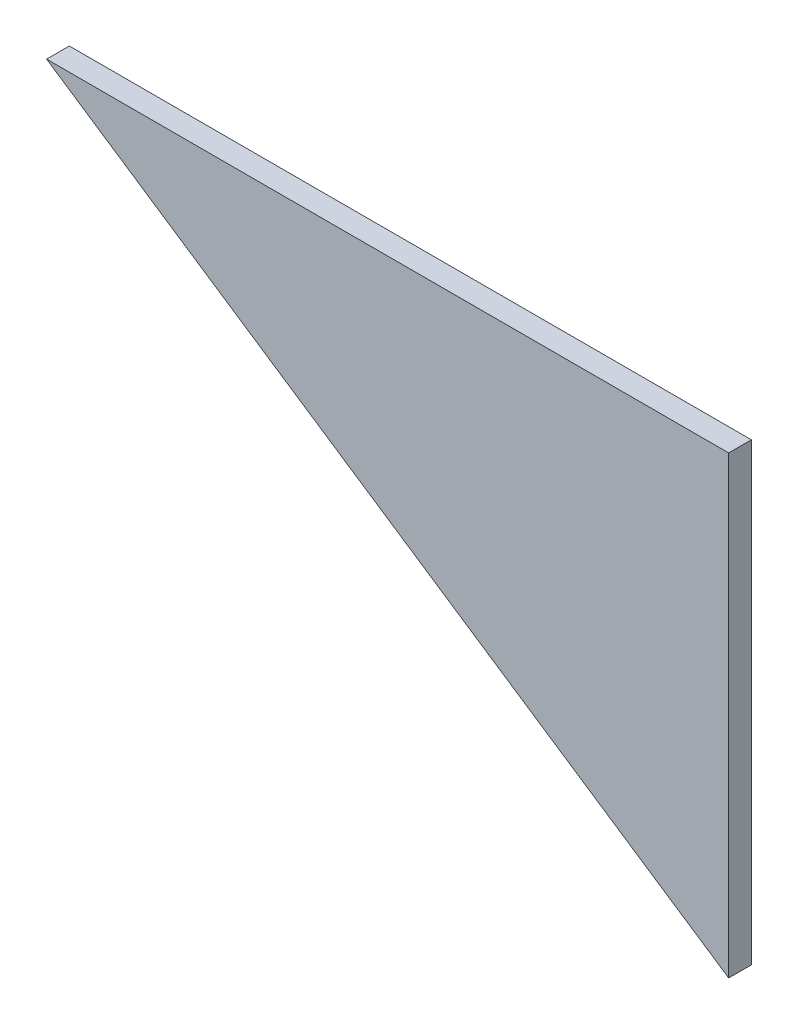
from build123d import *

# Parameters (mm, degrees)
ESTRUSIONE_ESTRUSIONE1_DEPTH = 5


with BuildPart() as part:
    # Schizzo1 → Estrusione-Estrusione1 (new body)
    with BuildSketch(Plane.XY):
        Polygon((0, 0), (-150, 100), (0, 100), align=None)
    extrude(amount=ESTRUSIONE_ESTRUSIONE1_DEPTH)


solid = part.part
